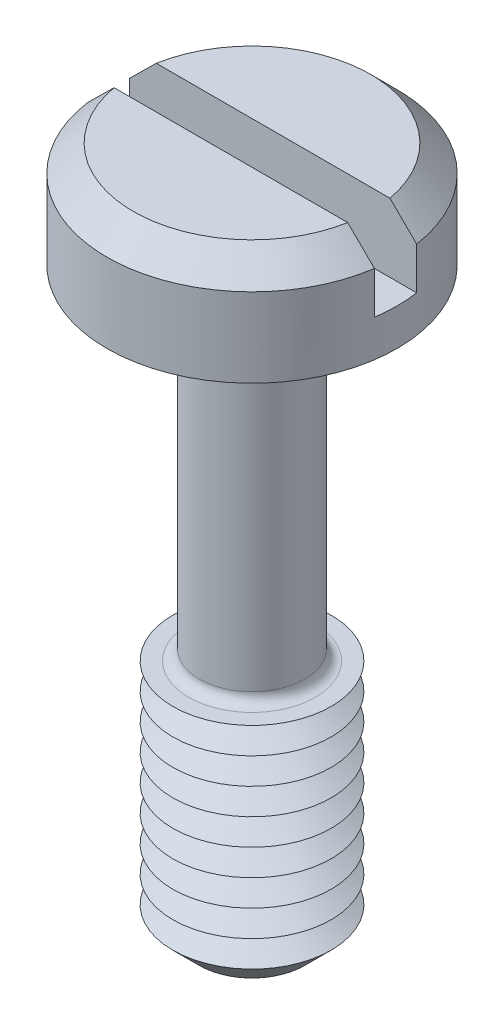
ISO-10303-21;
HEADER;
FILE_DESCRIPTION(('STEP AP214'),'2;1');
FILE_NAME('part.step','',(''),(''),'','','');
FILE_SCHEMA(('AUTOMOTIVE_DESIGN { 1 0 10303 214 1 1 1 1 }'));
ENDSEC;
DATA;
#1=APPLICATION_CONTEXT('core data for automotive mechanical design processes');
#2=APPLICATION_PROTOCOL_DEFINITION('international standard','automotive_design',2000,#1);
#3=PRODUCT_CONTEXT('',#1,'mechanical');
#4=PRODUCT('Part','Part','',(#3));
#5=PRODUCT_RELATED_PRODUCT_CATEGORY('part','',(#4));
#6=PRODUCT_DEFINITION_FORMATION('','',#4);
#7=PRODUCT_DEFINITION_CONTEXT('part definition',#1,'design');
#8=PRODUCT_DEFINITION('design','',#6,#7);
#9=PRODUCT_DEFINITION_SHAPE('','',#8);
#10=(LENGTH_UNIT() NAMED_UNIT(*) SI_UNIT(.MILLI.,.METRE.));
#11=(NAMED_UNIT(*) PLANE_ANGLE_UNIT() SI_UNIT($,.RADIAN.));
#12=(NAMED_UNIT(*) SI_UNIT($,.STERADIAN.) SOLID_ANGLE_UNIT());
#13=UNCERTAINTY_MEASURE_WITH_UNIT(LENGTH_MEASURE(1.E-05),#10,'distance_accuracy_value','');
#14=(GEOMETRIC_REPRESENTATION_CONTEXT(3) GLOBAL_UNCERTAINTY_ASSIGNED_CONTEXT((#13)) GLOBAL_UNIT_ASSIGNED_CONTEXT((#10,
#11,#12)) REPRESENTATION_CONTEXT('',''));
#15=CARTESIAN_POINT('',(0.,0.,0.));
#16=DIRECTION('',(0.,0.,1.));
#17=DIRECTION('',(1.,0.,0.));
#18=AXIS2_PLACEMENT_3D('',#15,#16,#17);
#19=CARTESIAN_POINT('',(0.,2.,0.));
#20=DIRECTION('',(0.,1.,0.));
#21=DIRECTION('',(0.,0.,1.));
#22=AXIS2_PLACEMENT_3D('',#19,#20,#21);
#23=PLANE('',#22);
#24=DIRECTION('',(-1.,0.,0.));
#25=VECTOR('',#24,1.);
#26=CARTESIAN_POINT('',(2.75,2.,-0.4));
#27=LINE('',#26,#25);
#28=CARTESIAN_POINT('',(2.21415898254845,2.,-0.4));
#29=VERTEX_POINT('',#28);
#30=CARTESIAN_POINT('',(-2.21415898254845,2.,-0.4));
#31=VERTEX_POINT('',#30);
#32=EDGE_CURVE('E110',#29,#31,#27,.T.);
#33=ORIENTED_EDGE('',*,*,#32,.F.);
#34=CARTESIAN_POINT('',(0.,2.,0.));
#35=DIRECTION('',(0.,1.,0.));
#36=DIRECTION('',(0.,0.,1.));
#37=AXIS2_PLACEMENT_3D('',#34,#35,#36);
#38=CIRCLE('',#37,2.25);
#39=EDGE_CURVE('E113',#29,#31,#38,.T.);
#40=ORIENTED_EDGE('',*,*,#39,.T.);
#41=EDGE_LOOP('',(#33,#40));
#42=FACE_BOUND('',#41,.T.);
#43=ADVANCED_FACE('F39',(#42),#23,.T.);
#44=CARTESIAN_POINT('',(0.,2.,0.));
#45=DIRECTION('',(0.,-1.,0.));
#46=DIRECTION('',(0.,0.,-1.));
#47=AXIS2_PLACEMENT_3D('',#44,#45,#46);
#48=CONICAL_SURFACE('',#47,2.25,0.785398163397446);
#49=CARTESIAN_POINT('',(6.05060089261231,-1.81380830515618,-0.4));
#50=CARTESIAN_POINT('',(5.84217393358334,-1.60583904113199,-0.4));
#51=CARTESIAN_POINT('',(5.63372707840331,-1.3978896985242,-0.4));
#52=CARTESIAN_POINT('',(5.21676338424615,-0.982052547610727,-0.4));
#53=CARTESIAN_POINT('',(5.00824654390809,-0.774164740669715,-0.4));
#54=CARTESIAN_POINT('',(4.59102343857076,-0.35838342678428,-0.4));
#55=CARTESIAN_POINT('',(4.38231713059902,-0.150489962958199,-0.4));
#56=CARTESIAN_POINT('',(3.96477014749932,0.265153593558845,-0.4));
#57=CARTESIAN_POINT('',(3.75592947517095,0.472903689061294,-0.4));
#58=CARTESIAN_POINT('',(3.33589913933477,0.890287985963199,-0.4));
#59=CARTESIAN_POINT('',(3.12470717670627,1.09991987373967,-0.4));
#60=CARTESIAN_POINT('',(2.70191340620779,1.51879562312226,-0.4));
#61=CARTESIAN_POINT('',(2.49031157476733,1.72803946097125,-0.4));
#62=CARTESIAN_POINT('',(2.17231429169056,2.04123939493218,-0.4));
#63=CARTESIAN_POINT('',(2.06623184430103,2.14551302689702,-0.4));
#64=CARTESIAN_POINT('',(1.85373145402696,2.35372301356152,-0.4));
#65=CARTESIAN_POINT('',(1.7473135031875,2.45765936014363,-0.4));
#66=CARTESIAN_POINT('',(1.53394692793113,2.6649644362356,-0.4));
#67=CARTESIAN_POINT('',(1.42699836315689,2.76833322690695,-0.4));
#68=CARTESIAN_POINT('',(1.26580938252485,2.92258234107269,-0.4));
#69=CARTESIAN_POINT('',(1.21195308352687,2.97386371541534,-0.4));
#70=CARTESIAN_POINT('',(1.10386632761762,3.07603025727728,-0.4));
#71=CARTESIAN_POINT('',(1.0496358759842,3.12691543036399,-0.4));
#72=CARTESIAN_POINT('',(0.96552909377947,3.20495157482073,-0.4));
#73=CARTESIAN_POINT('',(0.935852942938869,3.23231811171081,-0.4));
#74=CARTESIAN_POINT('',(0.876282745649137,3.28681446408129,-0.4));
#75=CARTESIAN_POINT('',(0.846388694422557,3.31394427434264,-0.4));
#76=CARTESIAN_POINT('',(0.786319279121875,3.3678876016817,-0.4));
#77=CARTESIAN_POINT('',(0.756143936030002,3.39470114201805,-0.4));
#78=CARTESIAN_POINT('',(0.695411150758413,3.44788757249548,-0.4));
#79=CARTESIAN_POINT('',(0.664853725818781,3.4742604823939,-0.4));
#80=CARTESIAN_POINT('',(0.58777305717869,3.53947080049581,-0.4));
#81=CARTESIAN_POINT('',(0.540923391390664,3.57793090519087,-0.4));
#82=CARTESIAN_POINT('',(0.469108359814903,3.63368803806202,-0.4));
#83=CARTESIAN_POINT('',(0.4449029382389,3.65195872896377,-0.4));
#84=CARTESIAN_POINT('',(0.395796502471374,3.68753467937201,-0.4));
#85=CARTESIAN_POINT('',(0.370895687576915,3.70484021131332,-0.4));
#86=CARTESIAN_POINT('',(0.315135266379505,3.74129905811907,-0.4));
#87=CARTESIAN_POINT('',(0.284069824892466,3.76014262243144,-0.4));
#88=CARTESIAN_POINT('',(0.220007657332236,3.79429188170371,-0.4));
#89=CARTESIAN_POINT('',(0.187014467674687,3.80960381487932,-0.4));
#90=CARTESIAN_POINT('',(0.12946932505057,3.83013103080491,-0.4));
#91=CARTESIAN_POINT('',(0.105533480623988,3.83700748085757,-0.4));
#92=CARTESIAN_POINT('',(0.0568861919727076,3.84667143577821,-0.4));
#93=CARTESIAN_POINT('',(0.0321777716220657,3.84947323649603,-0.4));
#94=CARTESIAN_POINT('',(-0.0174556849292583,3.85039131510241,-0.4));
#95=CARTESIAN_POINT('',(-0.0423811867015,3.84848412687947,-0.4));
#96=CARTESIAN_POINT('',(-0.0915464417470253,3.8403829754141,-0.4));
#97=CARTESIAN_POINT('',(-0.115784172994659,3.83417751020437,-0.4));
#98=CARTESIAN_POINT('',(-0.16401593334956,3.81830420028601,-0.4));
#99=CARTESIAN_POINT('',(-0.18796977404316,3.80851974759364,-0.4));
#100=CARTESIAN_POINT('',(-0.234812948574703,3.78663483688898,-0.4));
#101=CARTESIAN_POINT('',(-0.257700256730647,3.77453017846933,-0.4));
#102=CARTESIAN_POINT('',(-0.302761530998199,3.74868049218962,-0.4));
#103=CARTESIAN_POINT('',(-0.32492813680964,3.73492286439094,-0.4));
#104=CARTESIAN_POINT('',(-0.368536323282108,3.70635481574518,-0.4));
#105=CARTESIAN_POINT('',(-0.389978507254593,3.69154530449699,-0.4));
#106=CARTESIAN_POINT('',(-0.457169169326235,3.64340388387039,-0.4));
#107=CARTESIAN_POINT('',(-0.501937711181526,3.60871473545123,-0.4));
#108=CARTESIAN_POINT('',(-0.590074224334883,3.53759028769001,-0.4));
#109=CARTESIAN_POINT('',(-0.633441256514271,3.50115385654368,-0.4));
#110=CARTESIAN_POINT('',(-0.719371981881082,3.42718980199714,-0.4));
#111=CARTESIAN_POINT('',(-0.761934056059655,3.3896603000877,-0.4));
#112=CARTESIAN_POINT('',(-0.846465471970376,3.31396862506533,-0.4));
#113=CARTESIAN_POINT('',(-0.888434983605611,3.27580664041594,-0.4));
#114=CARTESIAN_POINT('',(-1.01351008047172,3.16091722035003,-0.4));
#115=CARTESIAN_POINT('',(-1.09603733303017,3.0835613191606,-0.4));
#116=CARTESIAN_POINT('',(-1.26020205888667,2.92809304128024,-0.4));
#117=CARTESIAN_POINT('',(-1.34184039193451,2.84998156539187,-0.4));
#118=CARTESIAN_POINT('',(-1.50425180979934,2.69362860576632,-0.4));
#119=CARTESIAN_POINT('',(-1.58502715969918,2.61538947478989,-0.4));
#120=CARTESIAN_POINT('',(-1.74627332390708,2.45859784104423,-0.4));
#121=CARTESIAN_POINT('',(-1.82674413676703,2.38004533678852,-0.4));
#122=CARTESIAN_POINT('',(-2.06785619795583,2.14407469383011,-0.4));
#123=CARTESIAN_POINT('',(-2.22819388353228,1.98634651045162,-0.4));
#124=CARTESIAN_POINT('',(-2.54852691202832,1.67040441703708,-0.4));
#125=CARTESIAN_POINT('',(-2.70852207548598,1.51219032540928,-0.4));
#126=CARTESIAN_POINT('',(-3.02826273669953,1.19551306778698,-0.4));
#127=CARTESIAN_POINT('',(-3.18800823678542,1.03704990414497,-0.4));
#128=CARTESIAN_POINT('',(-3.66699080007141,0.561455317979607,-0.4));
#129=CARTESIAN_POINT('',(-3.9859992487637,0.244093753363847,-0.4));
#130=CARTESIAN_POINT('',(-4.6236988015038,-0.390879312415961,-0.4));
#131=CARTESIAN_POINT('',(-4.94238993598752,-0.70849078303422,-0.4));
#132=CARTESIAN_POINT('',(-5.39262624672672,-1.15743192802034,-0.4));
#133=CARTESIAN_POINT('',(-5.52423897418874,-1.28869385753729,-0.4));
#134=CARTESIAN_POINT('',(-5.78743776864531,-1.5512369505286,-0.4));
#135=CARTESIAN_POINT('',(-5.91902383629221,-1.68251811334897,-0.4));
#136=CARTESIAN_POINT('',(-6.05060089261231,-1.81380830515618,-0.4));
#137=B_SPLINE_CURVE_WITH_KNOTS('',3,(#49,#50,#51,#52,#53,#54,#55,#56,#57,#58,#59,#60,#61,#62,
#63,#64,#65,#66,#67,#68,#69,#70,#71,#72,#73,#74,#75,#76,#77,#78,#79,#80,#81,#82,#83,#84,#85,#86,
#87,#88,#89,#90,#91,#92,#93,#94,#95,#96,#97,#98,#99,#100,#101,#102,#103,#104,#105,#106,#107,
#108,#109,#110,#111,#112,#113,#114,#115,#116,#117,#118,#119,#120,#121,#122,#123,#124,#125,#126,
#127,#128,#129,#130,#131,#132,#133,#134,#135,#136),.UNSPECIFIED.,.F.,.F.,(4,2,2,2,2,2,2,2,2,2,2,
2,2,2,2,2,2,2,2,2,2,2,2,2,2,2,2,2,2,2,2,2,2,2,2,2,2,2,2,2,2,2,2,4),(0.,0.88331033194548,
1.76663897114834,2.65038219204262,3.53410755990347,4.42681573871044,5.31957687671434,
5.76582544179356,6.21208466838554,6.65829482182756,6.88139126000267,7.10448455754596,
7.22558850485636,7.34669511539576,7.46779276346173,7.58888496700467,7.77066509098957,
7.86163037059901,7.95256984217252,8.06146372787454,8.17016376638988,8.24461141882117,
8.31879723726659,8.39335348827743,8.46811002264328,8.54555790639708,8.62314734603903,
8.70137101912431,8.77952785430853,8.94932745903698,9.1192385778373,9.28946128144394,
9.45963414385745,9.79895964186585,10.1379210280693,10.475282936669,10.8126464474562,
11.4873867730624,12.1624208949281,12.8374486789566,14.1873973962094,15.5372009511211,
16.0948428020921,16.6524687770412),.UNSPECIFIED.);
#138=CARTESIAN_POINT('',(2.72075357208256,1.5,-0.4));
#139=VERTEX_POINT('',#138);
#140=EDGE_CURVE('E259',#139,#29,#137,.T.);
#141=ORIENTED_EDGE('',*,*,#140,.F.);
#142=CARTESIAN_POINT('',(0.,1.5,0.));
#143=DIRECTION('',(0.,1.,0.));
#144=DIRECTION('',(0.,0.,1.));
#145=AXIS2_PLACEMENT_3D('',#142,#143,#144);
#146=CIRCLE('',#145,2.75);
#147=CARTESIAN_POINT('',(-2.72075357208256,1.5,-0.4));
#148=VERTEX_POINT('',#147);
#149=EDGE_CURVE('E127',#148,#139,#146,.F.);
#150=ORIENTED_EDGE('',*,*,#149,.F.);
#151=EDGE_CURVE('E102',#31,#148,#137,.T.);
#152=ORIENTED_EDGE('',*,*,#151,.F.);
#153=ORIENTED_EDGE('',*,*,#39,.F.);
#154=EDGE_LOOP('',(#141,#150,#152,#153));
#155=FACE_BOUND('',#154,.T.);
#156=ADVANCED_FACE('F221',(#155),#48,.T.);
#157=CARTESIAN_POINT('',(0.,-11.,0.));
#158=DIRECTION('',(0.,1.,0.));
#159=DIRECTION('',(0.,0.,1.));
#160=AXIS2_PLACEMENT_3D('',#157,#158,#159);
#161=CYLINDRICAL_SURFACE('',#160,1.);
#162=CARTESIAN_POINT('',(0.,-6.3,0.));
#163=DIRECTION('',(0.,-1.,0.));
#164=DIRECTION('',(0.,0.,-1.));
#165=AXIS2_PLACEMENT_3D('',#162,#163,#164);
#166=CIRCLE('',#165,1.);
#167=CARTESIAN_POINT('',(0.,-6.3,-1.));
#168=VERTEX_POINT('',#167);
#169=EDGE_CURVE('E122',#168,#168,#166,.F.);
#170=ORIENTED_EDGE('',*,*,#169,.T.);
#171=EDGE_LOOP('',(#170));
#172=FACE_BOUND('',#171,.T.);
#173=CARTESIAN_POINT('',(0.,-0.200000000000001,0.));
#174=DIRECTION('',(0.,1.,0.));
#175=DIRECTION('',(0.,0.,1.));
#176=AXIS2_PLACEMENT_3D('',#173,#174,#175);
#177=CIRCLE('',#176,1.);
#178=CARTESIAN_POINT('',(0.,-0.200000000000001,1.));
#179=VERTEX_POINT('',#178);
#180=EDGE_CURVE('E365',#179,#179,#177,.F.);
#181=ORIENTED_EDGE('',*,*,#180,.T.);
#182=EDGE_LOOP('',(#181));
#183=FACE_BOUND('',#182,.T.);
#184=ADVANCED_FACE('F217',(#172,#183),#161,.T.);
#185=CARTESIAN_POINT('',(0.,2.,0.));
#186=DIRECTION('',(0.,-1.,0.));
#187=DIRECTION('',(0.,0.,-1.));
#188=AXIS2_PLACEMENT_3D('',#185,#186,#187);
#189=CYLINDRICAL_SURFACE('',#188,2.75);
#190=ORIENTED_EDGE('',*,*,#149,.T.);
#191=DIRECTION('',(0.,-1.,0.));
#192=VECTOR('',#191,1.);
#193=CARTESIAN_POINT('',(2.72075357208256,2.,-0.4));
#194=LINE('',#193,#192);
#195=CARTESIAN_POINT('',(2.72075357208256,0.7,-0.4));
#196=VERTEX_POINT('',#195);
#197=EDGE_CURVE('E64',#139,#196,#194,.T.);
#198=ORIENTED_EDGE('',*,*,#197,.T.);
#199=CARTESIAN_POINT('',(0.,0.7,0.));
#200=DIRECTION('',(0.,1.,0.));
#201=DIRECTION('',(0.,0.,1.));
#202=AXIS2_PLACEMENT_3D('',#199,#200,#201);
#203=CIRCLE('',#202,2.75);
#204=CARTESIAN_POINT('',(2.72075357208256,0.7,0.4));
#205=VERTEX_POINT('',#204);
#206=EDGE_CURVE('E11',#205,#196,#203,.T.);
#207=ORIENTED_EDGE('',*,*,#206,.F.);
#208=DIRECTION('',(0.,-1.,0.));
#209=VECTOR('',#208,1.);
#210=CARTESIAN_POINT('',(2.72075357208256,2.,0.4));
#211=LINE('',#210,#209);
#212=CARTESIAN_POINT('',(2.72075357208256,1.5,0.4));
#213=VERTEX_POINT('',#212);
#214=EDGE_CURVE('E277',#205,#213,#211,.F.);
#215=ORIENTED_EDGE('',*,*,#214,.T.);
#216=CARTESIAN_POINT('',(-2.72075357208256,1.5,0.4));
#217=VERTEX_POINT('',#216);
#218=EDGE_CURVE('E119',#213,#217,#146,.F.);
#219=ORIENTED_EDGE('',*,*,#218,.T.);
#220=DIRECTION('',(0.,-1.,0.));
#221=VECTOR('',#220,1.);
#222=CARTESIAN_POINT('',(-2.72075357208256,2.,0.4));
#223=LINE('',#222,#221);
#224=CARTESIAN_POINT('',(-2.72075357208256,0.7,0.4));
#225=VERTEX_POINT('',#224);
#226=EDGE_CURVE('E96',#217,#225,#223,.T.);
#227=ORIENTED_EDGE('',*,*,#226,.T.);
#228=CARTESIAN_POINT('',(-2.72075357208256,0.7,-0.4));
#229=VERTEX_POINT('',#228);
#230=EDGE_CURVE('E44',#229,#225,#203,.T.);
#231=ORIENTED_EDGE('',*,*,#230,.F.);
#232=DIRECTION('',(0.,-1.,0.));
#233=VECTOR('',#232,1.);
#234=CARTESIAN_POINT('',(-2.72075357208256,2.,-0.4));
#235=LINE('',#234,#233);
#236=EDGE_CURVE('E281',#229,#148,#235,.F.);
#237=ORIENTED_EDGE('',*,*,#236,.T.);
#238=EDGE_LOOP('',(#190,#198,#207,#215,#219,#227,#231,#237));
#239=FACE_BOUND('',#238,.T.);
#240=CARTESIAN_POINT('',(0.,0.,0.));
#241=DIRECTION('',(0.,1.,0.));
#242=DIRECTION('',(0.,0.,1.));
#243=AXIS2_PLACEMENT_3D('',#240,#241,#242);
#244=CIRCLE('',#243,2.75);
#245=CARTESIAN_POINT('',(0.,0.,2.75));
#246=VERTEX_POINT('',#245);
#247=EDGE_CURVE('E354',#246,#246,#244,.T.);
#248=ORIENTED_EDGE('',*,*,#247,.T.);
#249=EDGE_LOOP('',(#248));
#250=FACE_BOUND('',#249,.T.);
#251=ADVANCED_FACE('F220',(#239,#250),#189,.T.);
#252=DIRECTION('',(1.,0.,0.));
#253=VECTOR('',#252,1.);
#254=CARTESIAN_POINT('',(2.75,2.,0.4));
#255=LINE('',#254,#253);
#256=CARTESIAN_POINT('',(-2.21415898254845,2.,0.4));
#257=VERTEX_POINT('',#256);
#258=CARTESIAN_POINT('',(2.21415898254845,2.,0.4));
#259=VERTEX_POINT('',#258);
#260=EDGE_CURVE('E56',#257,#259,#255,.T.);
#261=ORIENTED_EDGE('',*,*,#260,.F.);
#262=EDGE_CURVE('E108',#257,#259,#38,.T.);
#263=ORIENTED_EDGE('',*,*,#262,.T.);
#264=EDGE_LOOP('',(#261,#263));
#265=FACE_BOUND('',#264,.T.);
#266=ADVANCED_FACE('F107',(#265),#23,.T.);
#267=CARTESIAN_POINT('',(0.,0.,0.));
#268=DIRECTION('',(0.,1.,0.));
#269=DIRECTION('',(0.,0.,1.));
#270=AXIS2_PLACEMENT_3D('',#267,#268,#269);
#271=PLANE('',#270);
#272=CARTESIAN_POINT('',(0.,0.,0.));
#273=DIRECTION('',(0.,1.,0.));
#274=DIRECTION('',(0.,0.,1.));
#275=AXIS2_PLACEMENT_3D('',#272,#273,#274);
#276=CIRCLE('',#275,1.2);
#277=CARTESIAN_POINT('',(0.,0.,1.2));
#278=VERTEX_POINT('',#277);
#279=EDGE_CURVE('E114',#278,#278,#276,.T.);
#280=ORIENTED_EDGE('',*,*,#279,.T.);
#281=EDGE_LOOP('',(#280));
#282=FACE_BOUND('',#281,.T.);
#283=ORIENTED_EDGE('',*,*,#247,.F.);
#284=EDGE_LOOP('',(#283));
#285=FACE_BOUND('',#284,.T.);
#286=ADVANCED_FACE('F211',(#282,#285),#271,.F.);
#287=CARTESIAN_POINT('',(0.,-6.5,0.));
#288=DIRECTION('',(0.,-1.,0.));
#289=DIRECTION('',(0.,0.,-1.));
#290=AXIS2_PLACEMENT_3D('',#287,#288,#289);
#291=PLANE('',#290);
#292=CARTESIAN_POINT('',(0.,-6.5,0.));
#293=DIRECTION('',(0.,-1.,0.));
#294=DIRECTION('',(0.,0.,-1.));
#295=AXIS2_PLACEMENT_3D('',#292,#293,#294);
#296=CIRCLE('',#295,1.2);
#297=CARTESIAN_POINT('',(0.,-6.5,-1.2));
#298=VERTEX_POINT('',#297);
#299=EDGE_CURVE('E361',#298,#298,#296,.T.);
#300=ORIENTED_EDGE('',*,*,#299,.T.);
#301=EDGE_LOOP('',(#300));
#302=FACE_BOUND('',#301,.T.);
#303=CARTESIAN_POINT('',(0.,-6.5,0.));
#304=DIRECTION('',(0.,1.,0.));
#305=DIRECTION('',(0.,0.,1.));
#306=AXIS2_PLACEMENT_3D('',#303,#304,#305);
#307=CIRCLE('',#306,1.5);
#308=CARTESIAN_POINT('',(0.,-6.5,1.5));
#309=VERTEX_POINT('',#308);
#310=EDGE_CURVE('E350',#309,#309,#307,.T.);
#311=ORIENTED_EDGE('',*,*,#310,.T.);
#312=EDGE_LOOP('',(#311));
#313=FACE_BOUND('',#312,.T.);
#314=ADVANCED_FACE('F207',(#302,#313),#291,.F.);
#315=CARTESIAN_POINT('',(0.,-6.75,0.));
#316=DIRECTION('',(0.,1.,0.));
#317=DIRECTION('',(0.,0.,1.));
#318=AXIS2_PLACEMENT_3D('',#315,#316,#317);
#319=CONICAL_SURFACE('',#318,1.06698729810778,1.0471975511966);
#320=ORIENTED_EDGE('',*,*,#310,.F.);
#321=EDGE_LOOP('',(#320));
#322=FACE_BOUND('',#321,.T.);
#323=CARTESIAN_POINT('',(0.,-6.75,0.));
#324=DIRECTION('',(0.,1.,0.));
#325=DIRECTION('',(0.,0.,1.));
#326=AXIS2_PLACEMENT_3D('',#323,#324,#325);
#327=CIRCLE('',#326,1.06698729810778);
#328=CARTESIAN_POINT('',(0.,-6.75,1.06698729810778));
#329=VERTEX_POINT('',#328);
#330=EDGE_CURVE('E346',#329,#329,#327,.T.);
#331=ORIENTED_EDGE('',*,*,#330,.T.);
#332=EDGE_LOOP('',(#331));
#333=FACE_BOUND('',#332,.T.);
#334=ADVANCED_FACE('F203',(#322,#333),#319,.T.);
#335=CARTESIAN_POINT('',(0.,-7.,0.));
#336=DIRECTION('',(0.,-1.,0.));
#337=DIRECTION('',(0.,0.,-1.));
#338=AXIS2_PLACEMENT_3D('',#335,#336,#337);
#339=CONICAL_SURFACE('',#338,1.5,1.0471975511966);
#340=ORIENTED_EDGE('',*,*,#330,.F.);
#341=EDGE_LOOP('',(#340));
#342=FACE_BOUND('',#341,.T.);
#343=CARTESIAN_POINT('',(0.,-7.,0.));
#344=DIRECTION('',(0.,1.,0.));
#345=DIRECTION('',(0.,0.,1.));
#346=AXIS2_PLACEMENT_3D('',#343,#344,#345);
#347=CIRCLE('',#346,1.5);
#348=CARTESIAN_POINT('',(0.,-7.,1.5));
#349=VERTEX_POINT('',#348);
#350=EDGE_CURVE('E343',#349,#349,#347,.T.);
#351=ORIENTED_EDGE('',*,*,#350,.T.);
#352=EDGE_LOOP('',(#351));
#353=FACE_BOUND('',#352,.T.);
#354=ADVANCED_FACE('F199',(#342,#353),#339,.T.);
#355=CARTESIAN_POINT('',(0.,-7.25,0.));
#356=DIRECTION('',(0.,1.,0.));
#357=DIRECTION('',(0.,0.,1.));
#358=AXIS2_PLACEMENT_3D('',#355,#356,#357);
#359=CONICAL_SURFACE('',#358,1.06698729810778,1.0471975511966);
#360=ORIENTED_EDGE('',*,*,#350,.F.);
#361=EDGE_LOOP('',(#360));
#362=FACE_BOUND('',#361,.T.);
#363=CARTESIAN_POINT('',(0.,-7.25,0.));
#364=DIRECTION('',(0.,1.,0.));
#365=DIRECTION('',(0.,0.,1.));
#366=AXIS2_PLACEMENT_3D('',#363,#364,#365);
#367=CIRCLE('',#366,1.06698729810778);
#368=CARTESIAN_POINT('',(0.,-7.25,1.06698729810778));
#369=VERTEX_POINT('',#368);
#370=EDGE_CURVE('E339',#369,#369,#367,.T.);
#371=ORIENTED_EDGE('',*,*,#370,.T.);
#372=EDGE_LOOP('',(#371));
#373=FACE_BOUND('',#372,.T.);
#374=ADVANCED_FACE('F195',(#362,#373),#359,.T.);
#375=CARTESIAN_POINT('',(0.,-7.5,0.));
#376=DIRECTION('',(0.,-1.,0.));
#377=DIRECTION('',(0.,0.,-1.));
#378=AXIS2_PLACEMENT_3D('',#375,#376,#377);
#379=CONICAL_SURFACE('',#378,1.5,1.0471975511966);
#380=ORIENTED_EDGE('',*,*,#370,.F.);
#381=EDGE_LOOP('',(#380));
#382=FACE_BOUND('',#381,.T.);
#383=CARTESIAN_POINT('',(0.,-7.5,0.));
#384=DIRECTION('',(0.,1.,0.));
#385=DIRECTION('',(0.,0.,1.));
#386=AXIS2_PLACEMENT_3D('',#383,#384,#385);
#387=CIRCLE('',#386,1.5);
#388=CARTESIAN_POINT('',(0.,-7.5,1.5));
#389=VERTEX_POINT('',#388);
#390=EDGE_CURVE('E336',#389,#389,#387,.T.);
#391=ORIENTED_EDGE('',*,*,#390,.T.);
#392=EDGE_LOOP('',(#391));
#393=FACE_BOUND('',#392,.T.);
#394=ADVANCED_FACE('F191',(#382,#393),#379,.T.);
#395=CARTESIAN_POINT('',(0.,-7.75,0.));
#396=DIRECTION('',(0.,1.,0.));
#397=DIRECTION('',(0.,0.,1.));
#398=AXIS2_PLACEMENT_3D('',#395,#396,#397);
#399=CONICAL_SURFACE('',#398,1.06698729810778,1.0471975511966);
#400=ORIENTED_EDGE('',*,*,#390,.F.);
#401=EDGE_LOOP('',(#400));
#402=FACE_BOUND('',#401,.T.);
#403=CARTESIAN_POINT('',(0.,-7.75,0.));
#404=DIRECTION('',(0.,1.,0.));
#405=DIRECTION('',(0.,0.,1.));
#406=AXIS2_PLACEMENT_3D('',#403,#404,#405);
#407=CIRCLE('',#406,1.06698729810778);
#408=CARTESIAN_POINT('',(0.,-7.75,1.06698729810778));
#409=VERTEX_POINT('',#408);
#410=EDGE_CURVE('E332',#409,#409,#407,.T.);
#411=ORIENTED_EDGE('',*,*,#410,.T.);
#412=EDGE_LOOP('',(#411));
#413=FACE_BOUND('',#412,.T.);
#414=ADVANCED_FACE('F187',(#402,#413),#399,.T.);
#415=CARTESIAN_POINT('',(0.,-8.,0.));
#416=DIRECTION('',(0.,-1.,0.));
#417=DIRECTION('',(0.,0.,-1.));
#418=AXIS2_PLACEMENT_3D('',#415,#416,#417);
#419=CONICAL_SURFACE('',#418,1.5,1.0471975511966);
#420=ORIENTED_EDGE('',*,*,#410,.F.);
#421=EDGE_LOOP('',(#420));
#422=FACE_BOUND('',#421,.T.);
#423=CARTESIAN_POINT('',(0.,-8.,0.));
#424=DIRECTION('',(0.,1.,0.));
#425=DIRECTION('',(0.,0.,1.));
#426=AXIS2_PLACEMENT_3D('',#423,#424,#425);
#427=CIRCLE('',#426,1.5);
#428=CARTESIAN_POINT('',(0.,-8.,1.5));
#429=VERTEX_POINT('',#428);
#430=EDGE_CURVE('E328',#429,#429,#427,.T.);
#431=ORIENTED_EDGE('',*,*,#430,.T.);
#432=EDGE_LOOP('',(#431));
#433=FACE_BOUND('',#432,.T.);
#434=ADVANCED_FACE('F183',(#422,#433),#419,.T.);
#435=CARTESIAN_POINT('',(0.,-8.25,0.));
#436=DIRECTION('',(0.,1.,0.));
#437=DIRECTION('',(0.,0.,1.));
#438=AXIS2_PLACEMENT_3D('',#435,#436,#437);
#439=CONICAL_SURFACE('',#438,1.06698729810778,1.0471975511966);
#440=ORIENTED_EDGE('',*,*,#430,.F.);
#441=EDGE_LOOP('',(#440));
#442=FACE_BOUND('',#441,.T.);
#443=CARTESIAN_POINT('',(0.,-8.25,0.));
#444=DIRECTION('',(0.,1.,0.));
#445=DIRECTION('',(0.,0.,1.));
#446=AXIS2_PLACEMENT_3D('',#443,#444,#445);
#447=CIRCLE('',#446,1.06698729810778);
#448=CARTESIAN_POINT('',(0.,-8.25,1.06698729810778));
#449=VERTEX_POINT('',#448);
#450=EDGE_CURVE('E324',#449,#449,#447,.T.);
#451=ORIENTED_EDGE('',*,*,#450,.T.);
#452=EDGE_LOOP('',(#451));
#453=FACE_BOUND('',#452,.T.);
#454=ADVANCED_FACE('F179',(#442,#453),#439,.T.);
#455=CARTESIAN_POINT('',(0.,-8.5,0.));
#456=DIRECTION('',(0.,-1.,0.));
#457=DIRECTION('',(0.,0.,-1.));
#458=AXIS2_PLACEMENT_3D('',#455,#456,#457);
#459=CONICAL_SURFACE('',#458,1.5,1.0471975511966);
#460=ORIENTED_EDGE('',*,*,#450,.F.);
#461=EDGE_LOOP('',(#460));
#462=FACE_BOUND('',#461,.T.);
#463=CARTESIAN_POINT('',(0.,-8.5,0.));
#464=DIRECTION('',(0.,1.,0.));
#465=DIRECTION('',(0.,0.,1.));
#466=AXIS2_PLACEMENT_3D('',#463,#464,#465);
#467=CIRCLE('',#466,1.5);
#468=CARTESIAN_POINT('',(0.,-8.5,1.5));
#469=VERTEX_POINT('',#468);
#470=EDGE_CURVE('E320',#469,#469,#467,.T.);
#471=ORIENTED_EDGE('',*,*,#470,.T.);
#472=EDGE_LOOP('',(#471));
#473=FACE_BOUND('',#472,.T.);
#474=ADVANCED_FACE('F175',(#462,#473),#459,.T.);
#475=CARTESIAN_POINT('',(0.,-8.75,0.));
#476=DIRECTION('',(0.,1.,0.));
#477=DIRECTION('',(0.,0.,1.));
#478=AXIS2_PLACEMENT_3D('',#475,#476,#477);
#479=CONICAL_SURFACE('',#478,1.06698729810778,1.0471975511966);
#480=ORIENTED_EDGE('',*,*,#470,.F.);
#481=EDGE_LOOP('',(#480));
#482=FACE_BOUND('',#481,.T.);
#483=CARTESIAN_POINT('',(0.,-8.75,0.));
#484=DIRECTION('',(0.,1.,0.));
#485=DIRECTION('',(0.,0.,1.));
#486=AXIS2_PLACEMENT_3D('',#483,#484,#485);
#487=CIRCLE('',#486,1.06698729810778);
#488=CARTESIAN_POINT('',(0.,-8.75,1.06698729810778));
#489=VERTEX_POINT('',#488);
#490=EDGE_CURVE('E316',#489,#489,#487,.T.);
#491=ORIENTED_EDGE('',*,*,#490,.T.);
#492=EDGE_LOOP('',(#491));
#493=FACE_BOUND('',#492,.T.);
#494=ADVANCED_FACE('F171',(#482,#493),#479,.T.);
#495=CARTESIAN_POINT('',(0.,-9.,0.));
#496=DIRECTION('',(0.,-1.,0.));
#497=DIRECTION('',(0.,0.,-1.));
#498=AXIS2_PLACEMENT_3D('',#495,#496,#497);
#499=CONICAL_SURFACE('',#498,1.5,1.0471975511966);
#500=ORIENTED_EDGE('',*,*,#490,.F.);
#501=EDGE_LOOP('',(#500));
#502=FACE_BOUND('',#501,.T.);
#503=CARTESIAN_POINT('',(0.,-9.,0.));
#504=DIRECTION('',(0.,1.,0.));
#505=DIRECTION('',(0.,0.,1.));
#506=AXIS2_PLACEMENT_3D('',#503,#504,#505);
#507=CIRCLE('',#506,1.5);
#508=CARTESIAN_POINT('',(0.,-9.,1.5));
#509=VERTEX_POINT('',#508);
#510=EDGE_CURVE('E313',#509,#509,#507,.T.);
#511=ORIENTED_EDGE('',*,*,#510,.T.);
#512=EDGE_LOOP('',(#511));
#513=FACE_BOUND('',#512,.T.);
#514=ADVANCED_FACE('F167',(#502,#513),#499,.T.);
#515=CARTESIAN_POINT('',(0.,-9.25,0.));
#516=DIRECTION('',(0.,1.,0.));
#517=DIRECTION('',(0.,0.,1.));
#518=AXIS2_PLACEMENT_3D('',#515,#516,#517);
#519=CONICAL_SURFACE('',#518,1.06698729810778,1.0471975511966);
#520=ORIENTED_EDGE('',*,*,#510,.F.);
#521=EDGE_LOOP('',(#520));
#522=FACE_BOUND('',#521,.T.);
#523=CARTESIAN_POINT('',(0.,-9.25,0.));
#524=DIRECTION('',(0.,1.,0.));
#525=DIRECTION('',(0.,0.,1.));
#526=AXIS2_PLACEMENT_3D('',#523,#524,#525);
#527=CIRCLE('',#526,1.06698729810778);
#528=CARTESIAN_POINT('',(0.,-9.25,1.06698729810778));
#529=VERTEX_POINT('',#528);
#530=EDGE_CURVE('E310',#529,#529,#527,.T.);
#531=ORIENTED_EDGE('',*,*,#530,.T.);
#532=EDGE_LOOP('',(#531));
#533=FACE_BOUND('',#532,.T.);
#534=ADVANCED_FACE('F163',(#522,#533),#519,.T.);
#535=CARTESIAN_POINT('',(0.,-9.5,0.));
#536=DIRECTION('',(0.,-1.,0.));
#537=DIRECTION('',(0.,0.,-1.));
#538=AXIS2_PLACEMENT_3D('',#535,#536,#537);
#539=CONICAL_SURFACE('',#538,1.5,1.0471975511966);
#540=ORIENTED_EDGE('',*,*,#530,.F.);
#541=EDGE_LOOP('',(#540));
#542=FACE_BOUND('',#541,.T.);
#543=CARTESIAN_POINT('',(0.,-9.5,0.));
#544=DIRECTION('',(0.,1.,0.));
#545=DIRECTION('',(0.,0.,1.));
#546=AXIS2_PLACEMENT_3D('',#543,#544,#545);
#547=CIRCLE('',#546,1.5);
#548=CARTESIAN_POINT('',(0.,-9.5,1.5));
#549=VERTEX_POINT('',#548);
#550=EDGE_CURVE('E307',#549,#549,#547,.T.);
#551=ORIENTED_EDGE('',*,*,#550,.T.);
#552=EDGE_LOOP('',(#551));
#553=FACE_BOUND('',#552,.T.);
#554=ADVANCED_FACE('F159',(#542,#553),#539,.T.);
#555=CARTESIAN_POINT('',(0.,-9.75,0.));
#556=DIRECTION('',(0.,1.,0.));
#557=DIRECTION('',(0.,0.,1.));
#558=AXIS2_PLACEMENT_3D('',#555,#556,#557);
#559=CONICAL_SURFACE('',#558,1.06698729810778,1.0471975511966);
#560=ORIENTED_EDGE('',*,*,#550,.F.);
#561=EDGE_LOOP('',(#560));
#562=FACE_BOUND('',#561,.T.);
#563=CARTESIAN_POINT('',(0.,-9.75,0.));
#564=DIRECTION('',(0.,1.,0.));
#565=DIRECTION('',(0.,0.,1.));
#566=AXIS2_PLACEMENT_3D('',#563,#564,#565);
#567=CIRCLE('',#566,1.06698729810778);
#568=CARTESIAN_POINT('',(0.,-9.75,1.06698729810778));
#569=VERTEX_POINT('',#568);
#570=EDGE_CURVE('E303',#569,#569,#567,.T.);
#571=ORIENTED_EDGE('',*,*,#570,.T.);
#572=EDGE_LOOP('',(#571));
#573=FACE_BOUND('',#572,.T.);
#574=ADVANCED_FACE('F155',(#562,#573),#559,.T.);
#575=CARTESIAN_POINT('',(0.,-10.,0.));
#576=DIRECTION('',(0.,-1.,0.));
#577=DIRECTION('',(0.,0.,-1.));
#578=AXIS2_PLACEMENT_3D('',#575,#576,#577);
#579=CONICAL_SURFACE('',#578,1.5,1.0471975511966);
#580=ORIENTED_EDGE('',*,*,#570,.F.);
#581=EDGE_LOOP('',(#580));
#582=FACE_BOUND('',#581,.T.);
#583=CARTESIAN_POINT('',(0.,-10.,0.));
#584=DIRECTION('',(0.,1.,0.));
#585=DIRECTION('',(0.,0.,1.));
#586=AXIS2_PLACEMENT_3D('',#583,#584,#585);
#587=CIRCLE('',#586,1.5);
#588=CARTESIAN_POINT('',(0.,-10.,1.5));
#589=VERTEX_POINT('',#588);
#590=EDGE_CURVE('E299',#589,#589,#587,.T.);
#591=ORIENTED_EDGE('',*,*,#590,.T.);
#592=EDGE_LOOP('',(#591));
#593=FACE_BOUND('',#592,.T.);
#594=ADVANCED_FACE('F151',(#582,#593),#579,.T.);
#595=CARTESIAN_POINT('',(0.,-10.25,0.));
#596=DIRECTION('',(0.,1.,0.));
#597=DIRECTION('',(0.,0.,1.));
#598=AXIS2_PLACEMENT_3D('',#595,#596,#597);
#599=CONICAL_SURFACE('',#598,1.06698729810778,1.0471975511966);
#600=ORIENTED_EDGE('',*,*,#590,.F.);
#601=EDGE_LOOP('',(#600));
#602=FACE_BOUND('',#601,.T.);
#603=CARTESIAN_POINT('',(0.,-10.25,0.));
#604=DIRECTION('',(0.,1.,0.));
#605=DIRECTION('',(0.,0.,1.));
#606=AXIS2_PLACEMENT_3D('',#603,#604,#605);
#607=CIRCLE('',#606,1.06698729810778);
#608=CARTESIAN_POINT('',(0.,-10.25,1.06698729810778));
#609=VERTEX_POINT('',#608);
#610=EDGE_CURVE('E295',#609,#609,#607,.T.);
#611=ORIENTED_EDGE('',*,*,#610,.T.);
#612=EDGE_LOOP('',(#611));
#613=FACE_BOUND('',#612,.T.);
#614=ADVANCED_FACE('F147',(#602,#613),#599,.T.);
#615=CARTESIAN_POINT('',(0.,-10.5,0.));
#616=DIRECTION('',(0.,-1.,0.));
#617=DIRECTION('',(0.,0.,-1.));
#618=AXIS2_PLACEMENT_3D('',#615,#616,#617);
#619=CONICAL_SURFACE('',#618,1.5,1.0471975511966);
#620=ORIENTED_EDGE('',*,*,#610,.F.);
#621=EDGE_LOOP('',(#620));
#622=FACE_BOUND('',#621,.T.);
#623=CARTESIAN_POINT('',(0.,-10.5,0.));
#624=DIRECTION('',(0.,1.,0.));
#625=DIRECTION('',(0.,0.,1.));
#626=AXIS2_PLACEMENT_3D('',#623,#624,#625);
#627=CIRCLE('',#626,1.5);
#628=CARTESIAN_POINT('',(0.,-10.5,1.5));
#629=VERTEX_POINT('',#628);
#630=EDGE_CURVE('E291',#629,#629,#627,.T.);
#631=ORIENTED_EDGE('',*,*,#630,.T.);
#632=EDGE_LOOP('',(#631));
#633=FACE_BOUND('',#632,.T.);
#634=ADVANCED_FACE('F143',(#622,#633),#619,.T.);
#635=CARTESIAN_POINT('',(0.,-11.,0.));
#636=DIRECTION('',(0.,-1.,0.));
#637=DIRECTION('',(0.,0.,-1.));
#638=AXIS2_PLACEMENT_3D('',#635,#636,#637);
#639=PLANE('',#638);
#640=CARTESIAN_POINT('',(0.,-11.,0.));
#641=DIRECTION('',(0.,-1.,0.));
#642=DIRECTION('',(0.,0.,-1.));
#643=AXIS2_PLACEMENT_3D('',#640,#641,#642);
#644=CIRCLE('',#643,0.999999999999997);
#645=CARTESIAN_POINT('',(0.,-11.,-0.999999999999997));
#646=VERTEX_POINT('',#645);
#647=EDGE_CURVE('E358',#646,#646,#644,.T.);
#648=ORIENTED_EDGE('',*,*,#647,.T.);
#649=EDGE_LOOP('',(#648));
#650=FACE_BOUND('',#649,.T.);
#651=ADVANCED_FACE('F146',(#650),#639,.T.);
#652=CARTESIAN_POINT('',(0.,-11.,0.));
#653=DIRECTION('',(0.,1.,0.));
#654=DIRECTION('',(0.,0.,1.));
#655=AXIS2_PLACEMENT_3D('',#652,#653,#654);
#656=CONICAL_SURFACE('',#655,0.999999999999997,0.785398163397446);
#657=ORIENTED_EDGE('',*,*,#630,.F.);
#658=EDGE_LOOP('',(#657));
#659=FACE_BOUND('',#658,.T.);
#660=ORIENTED_EDGE('',*,*,#647,.F.);
#661=EDGE_LOOP('',(#660));
#662=FACE_BOUND('',#661,.T.);
#663=ADVANCED_FACE('F215',(#659,#662),#656,.T.);
#664=CARTESIAN_POINT('',(0.,-6.3,0.));
#665=DIRECTION('',(0.,-1.,0.));
#666=DIRECTION('',(0.,0.,-1.));
#667=AXIS2_PLACEMENT_3D('',#664,#665,#666);
#668=TOROIDAL_SURFACE('',#667,1.2,0.2);
#669=ORIENTED_EDGE('',*,*,#169,.F.);
#670=EDGE_LOOP('',(#669));
#671=FACE_BOUND('',#670,.T.);
#672=ORIENTED_EDGE('',*,*,#299,.F.);
#673=EDGE_LOOP('',(#672));
#674=FACE_BOUND('',#673,.T.);
#675=ADVANCED_FACE('F233',(#671,#674),#668,.F.);
#676=CARTESIAN_POINT('',(0.,-0.200000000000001,0.));
#677=DIRECTION('',(0.,1.,0.));
#678=DIRECTION('',(0.,0.,1.));
#679=AXIS2_PLACEMENT_3D('',#676,#677,#678);
#680=TOROIDAL_SURFACE('',#679,1.2,0.2);
#681=ORIENTED_EDGE('',*,*,#279,.F.);
#682=EDGE_LOOP('',(#681));
#683=FACE_BOUND('',#682,.T.);
#684=ORIENTED_EDGE('',*,*,#180,.F.);
#685=EDGE_LOOP('',(#684));
#686=FACE_BOUND('',#685,.T.);
#687=ADVANCED_FACE('F236',(#683,#686),#680,.F.);
#688=CARTESIAN_POINT('',(-6.05060089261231,-1.81380830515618,0.4));
#689=CARTESIAN_POINT('',(-5.84217393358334,-1.60583904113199,0.4));
#690=CARTESIAN_POINT('',(-5.63372707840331,-1.3978896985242,0.4));
#691=CARTESIAN_POINT('',(-5.21676338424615,-0.982052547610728,0.4));
#692=CARTESIAN_POINT('',(-5.00824654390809,-0.774164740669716,0.4));
#693=CARTESIAN_POINT('',(-4.59102343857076,-0.358383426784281,0.4));
#694=CARTESIAN_POINT('',(-4.38231713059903,-0.150489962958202,0.4));
#695=CARTESIAN_POINT('',(-3.96477014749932,0.265153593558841,0.4));
#696=CARTESIAN_POINT('',(-3.75592947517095,0.47290368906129,0.4));
#697=CARTESIAN_POINT('',(-3.33589913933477,0.890287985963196,0.4));
#698=CARTESIAN_POINT('',(-3.12470717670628,1.09991987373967,0.4));
#699=CARTESIAN_POINT('',(-2.7019134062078,1.51879562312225,0.4));
#700=CARTESIAN_POINT('',(-2.49031157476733,1.72803946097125,0.4));
#701=CARTESIAN_POINT('',(-2.17231429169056,2.04123939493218,0.4));
#702=CARTESIAN_POINT('',(-2.06623184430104,2.14551302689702,0.4));
#703=CARTESIAN_POINT('',(-1.85373145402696,2.35372301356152,0.4));
#704=CARTESIAN_POINT('',(-1.7473135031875,2.45765936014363,0.4));
#705=CARTESIAN_POINT('',(-1.53394692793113,2.6649644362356,0.4));
#706=CARTESIAN_POINT('',(-1.42699836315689,2.76833322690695,0.4));
#707=CARTESIAN_POINT('',(-1.26580938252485,2.92258234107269,0.4));
#708=CARTESIAN_POINT('',(-1.21195308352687,2.97386371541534,0.4));
#709=CARTESIAN_POINT('',(-1.10386632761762,3.07603025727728,0.4));
#710=CARTESIAN_POINT('',(-1.0496358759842,3.12691543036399,0.4));
#711=CARTESIAN_POINT('',(-0.96552909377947,3.20495157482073,0.4));
#712=CARTESIAN_POINT('',(-0.935852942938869,3.23231811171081,0.4));
#713=CARTESIAN_POINT('',(-0.876282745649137,3.28681446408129,0.4));
#714=CARTESIAN_POINT('',(-0.846388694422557,3.31394427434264,0.4));
#715=CARTESIAN_POINT('',(-0.786319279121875,3.3678876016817,0.4));
#716=CARTESIAN_POINT('',(-0.756143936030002,3.39470114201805,0.4));
#717=CARTESIAN_POINT('',(-0.695411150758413,3.44788757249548,0.4));
#718=CARTESIAN_POINT('',(-0.664853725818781,3.4742604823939,0.4));
#719=CARTESIAN_POINT('',(-0.58777305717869,3.53947080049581,0.4));
#720=CARTESIAN_POINT('',(-0.540923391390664,3.57793090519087,0.4));
#721=CARTESIAN_POINT('',(-0.469108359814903,3.63368803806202,0.4));
#722=CARTESIAN_POINT('',(-0.4449029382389,3.65195872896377,0.4));
#723=CARTESIAN_POINT('',(-0.395796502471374,3.68753467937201,0.4));
#724=CARTESIAN_POINT('',(-0.370895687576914,3.70484021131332,0.4));
#725=CARTESIAN_POINT('',(-0.315135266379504,3.74129905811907,0.4));
#726=CARTESIAN_POINT('',(-0.284069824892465,3.76014262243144,0.4));
#727=CARTESIAN_POINT('',(-0.220007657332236,3.79429188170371,0.4));
#728=CARTESIAN_POINT('',(-0.187014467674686,3.80960381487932,0.4));
#729=CARTESIAN_POINT('',(-0.12946932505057,3.83013103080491,0.4));
#730=CARTESIAN_POINT('',(-0.105533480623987,3.83700748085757,0.4));
#731=CARTESIAN_POINT('',(-0.0568861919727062,3.84667143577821,0.4));
#732=CARTESIAN_POINT('',(-0.0321777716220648,3.84947323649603,0.4));
#733=CARTESIAN_POINT('',(0.0174556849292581,3.85039131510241,0.4));
#734=CARTESIAN_POINT('',(0.0423811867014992,3.84848412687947,0.4));
#735=CARTESIAN_POINT('',(0.0915464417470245,3.8403829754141,0.4));
#736=CARTESIAN_POINT('',(0.115784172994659,3.83417751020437,0.4));
#737=CARTESIAN_POINT('',(0.16401593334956,3.81830420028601,0.4));
#738=CARTESIAN_POINT('',(0.18796977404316,3.80851974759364,0.4));
#739=CARTESIAN_POINT('',(0.234812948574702,3.78663483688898,0.4));
#740=CARTESIAN_POINT('',(0.257700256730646,3.77453017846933,0.4));
#741=CARTESIAN_POINT('',(0.302761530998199,3.74868049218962,0.4));
#742=CARTESIAN_POINT('',(0.32492813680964,3.73492286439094,0.4));
#743=CARTESIAN_POINT('',(0.368536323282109,3.70635481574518,0.4));
#744=CARTESIAN_POINT('',(0.389978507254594,3.69154530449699,0.4));
#745=CARTESIAN_POINT('',(0.457169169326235,3.64340388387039,0.4));
#746=CARTESIAN_POINT('',(0.501937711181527,3.60871473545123,0.4));
#747=CARTESIAN_POINT('',(0.590074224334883,3.53759028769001,0.4));
#748=CARTESIAN_POINT('',(0.633441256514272,3.50115385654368,0.4));
#749=CARTESIAN_POINT('',(0.719371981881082,3.42718980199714,0.4));
#750=CARTESIAN_POINT('',(0.761934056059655,3.3896603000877,0.4));
#751=CARTESIAN_POINT('',(0.846465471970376,3.31396862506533,0.4));
#752=CARTESIAN_POINT('',(0.888434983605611,3.27580664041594,0.4));
#753=CARTESIAN_POINT('',(1.01351008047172,3.16091722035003,0.4));
#754=CARTESIAN_POINT('',(1.09603733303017,3.0835613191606,0.4));
#755=CARTESIAN_POINT('',(1.26020205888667,2.92809304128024,0.4));
#756=CARTESIAN_POINT('',(1.34184039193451,2.84998156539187,0.4));
#757=CARTESIAN_POINT('',(1.50425180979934,2.69362860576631,0.4));
#758=CARTESIAN_POINT('',(1.58502715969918,2.61538947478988,0.4));
#759=CARTESIAN_POINT('',(1.74627332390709,2.45859784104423,0.4));
#760=CARTESIAN_POINT('',(1.82674413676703,2.38004533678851,0.4));
#761=CARTESIAN_POINT('',(2.06785619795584,2.1440746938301,0.4));
#762=CARTESIAN_POINT('',(2.22819388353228,1.98634651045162,0.4));
#763=CARTESIAN_POINT('',(2.54852691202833,1.67040441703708,0.4));
#764=CARTESIAN_POINT('',(2.70852207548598,1.51219032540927,0.4));
#765=CARTESIAN_POINT('',(3.02826273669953,1.19551306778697,0.4));
#766=CARTESIAN_POINT('',(3.18800823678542,1.03704990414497,0.4));
#767=CARTESIAN_POINT('',(3.66699080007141,0.561455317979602,0.4));
#768=CARTESIAN_POINT('',(3.9859992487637,0.244093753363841,0.4));
#769=CARTESIAN_POINT('',(4.62369880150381,-0.390879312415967,0.4));
#770=CARTESIAN_POINT('',(4.94238993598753,-0.708490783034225,0.4));
#771=CARTESIAN_POINT('',(5.39262624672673,-1.15743192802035,0.4));
#772=CARTESIAN_POINT('',(5.52423897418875,-1.2886938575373,0.4));
#773=CARTESIAN_POINT('',(5.78743776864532,-1.5512369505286,0.4));
#774=CARTESIAN_POINT('',(5.91902383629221,-1.68251811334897,0.4));
#775=CARTESIAN_POINT('',(6.05060089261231,-1.81380830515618,0.4));
#776=B_SPLINE_CURVE_WITH_KNOTS('',3,(#688,#689,#690,#691,#692,#693,#694,#695,#696,#697,#698,
#699,#700,#701,#702,#703,#704,#705,#706,#707,#708,#709,#710,#711,#712,#713,#714,#715,#716,#717,
#718,#719,#720,#721,#722,#723,#724,#725,#726,#727,#728,#729,#730,#731,#732,#733,#734,#735,#736,
#737,#738,#739,#740,#741,#742,#743,#744,#745,#746,#747,#748,#749,#750,#751,#752,#753,#754,#755,
#756,#757,#758,#759,#760,#761,#762,#763,#764,#765,#766,#767,#768,#769,#770,#771,#772,#773,#774,
#775),.UNSPECIFIED.,.F.,.F.,(4,2,2,2,2,2,2,2,2,2,2,2,2,2,2,2,2,2,2,2,2,2,2,2,2,2,2,2,2,2,2,2,2,
2,2,2,2,2,2,2,2,2,2,4),(0.,0.883310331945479,1.76663897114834,2.65038219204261,3.53410755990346,
4.42681573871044,5.31957687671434,5.76582544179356,6.21208466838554,6.65829482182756,
6.88139126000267,7.10448455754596,7.22558850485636,7.34669511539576,7.46779276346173,
7.58888496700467,7.77066509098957,7.86163037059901,7.95256984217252,8.06146372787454,
8.17016376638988,8.24461141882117,8.31879723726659,8.39335348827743,8.46811002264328,
8.54555790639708,8.62314734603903,8.70137101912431,8.77952785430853,8.94932745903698,
9.1192385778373,9.28946128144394,9.45963414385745,9.79895964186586,10.1379210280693,
10.475282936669,10.8126464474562,11.4873867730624,12.1624208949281,12.8374486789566,
14.1873973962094,15.5372009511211,16.0948428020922,16.6524687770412),.UNSPECIFIED.);
#777=EDGE_CURVE('E92',#217,#257,#776,.T.);
#778=ORIENTED_EDGE('',*,*,#777,.F.);
#779=ORIENTED_EDGE('',*,*,#218,.F.);
#780=EDGE_CURVE('E103',#259,#213,#776,.T.);
#781=ORIENTED_EDGE('',*,*,#780,.F.);
#782=ORIENTED_EDGE('',*,*,#262,.F.);
#783=EDGE_LOOP('',(#778,#779,#781,#782));
#784=FACE_BOUND('',#783,.T.);
#785=ADVANCED_FACE('F41',(#784),#48,.T.);
#786=CARTESIAN_POINT('',(0.,0.7,0.));
#787=DIRECTION('',(0.,1.,0.));
#788=DIRECTION('',(0.,0.,1.));
#789=AXIS2_PLACEMENT_3D('',#786,#787,#788);
#790=PLANE('',#789);
#791=DIRECTION('',(1.,0.,0.));
#792=VECTOR('',#791,1.);
#793=CARTESIAN_POINT('',(2.75,0.7,0.4));
#794=LINE('',#793,#792);
#795=EDGE_CURVE('E256',#225,#205,#794,.T.);
#796=ORIENTED_EDGE('',*,*,#795,.T.);
#797=ORIENTED_EDGE('',*,*,#206,.T.);
#798=DIRECTION('',(-1.,0.,0.));
#799=VECTOR('',#798,1.);
#800=CARTESIAN_POINT('',(2.75,0.7,-0.4));
#801=LINE('',#800,#799);
#802=EDGE_CURVE('E274',#196,#229,#801,.T.);
#803=ORIENTED_EDGE('',*,*,#802,.T.);
#804=ORIENTED_EDGE('',*,*,#230,.T.);
#805=EDGE_LOOP('',(#796,#797,#803,#804));
#806=FACE_BOUND('',#805,.T.);
#807=ADVANCED_FACE('F243',(#806),#790,.T.);
#808=CARTESIAN_POINT('',(2.75,0.7,-0.4));
#809=DIRECTION('',(0.,0.,-1.));
#810=DIRECTION('',(-1.,0.,0.));
#811=AXIS2_PLACEMENT_3D('',#808,#809,#810);
#812=PLANE('',#811);
#813=ORIENTED_EDGE('',*,*,#140,.T.);
#814=ORIENTED_EDGE('',*,*,#32,.T.);
#815=ORIENTED_EDGE('',*,*,#151,.T.);
#816=ORIENTED_EDGE('',*,*,#236,.F.);
#817=ORIENTED_EDGE('',*,*,#802,.F.);
#818=ORIENTED_EDGE('',*,*,#197,.F.);
#819=EDGE_LOOP('',(#813,#814,#815,#816,#817,#818));
#820=FACE_BOUND('',#819,.T.);
#821=ADVANCED_FACE('F140',(#820),#812,.F.);
#822=CARTESIAN_POINT('',(2.75,0.7,0.4));
#823=DIRECTION('',(0.,0.,1.));
#824=DIRECTION('',(1.,0.,0.));
#825=AXIS2_PLACEMENT_3D('',#822,#823,#824);
#826=PLANE('',#825);
#827=ORIENTED_EDGE('',*,*,#777,.T.);
#828=ORIENTED_EDGE('',*,*,#260,.T.);
#829=ORIENTED_EDGE('',*,*,#780,.T.);
#830=ORIENTED_EDGE('',*,*,#214,.F.);
#831=ORIENTED_EDGE('',*,*,#795,.F.);
#832=ORIENTED_EDGE('',*,*,#226,.F.);
#833=EDGE_LOOP('',(#827,#828,#829,#830,#831,#832));
#834=FACE_BOUND('',#833,.T.);
#835=ADVANCED_FACE('F93',(#834),#826,.F.);
#836=CLOSED_SHELL('',(#43,#156,#184,#251,#266,#286,#314,#334,#354,#374,#394,#414,#434,#454,#474,
#494,#514,#534,#554,#574,#594,#614,#634,#651,#663,#675,#687,#785,#807,#821,#835));
#837=MANIFOLD_SOLID_BREP('B2',#836);
#838=ADVANCED_BREP_SHAPE_REPRESENTATION('',(#18,#837),#14);
#839=SHAPE_DEFINITION_REPRESENTATION(#9,#838);
ENDSEC;
END-ISO-10303-21;
